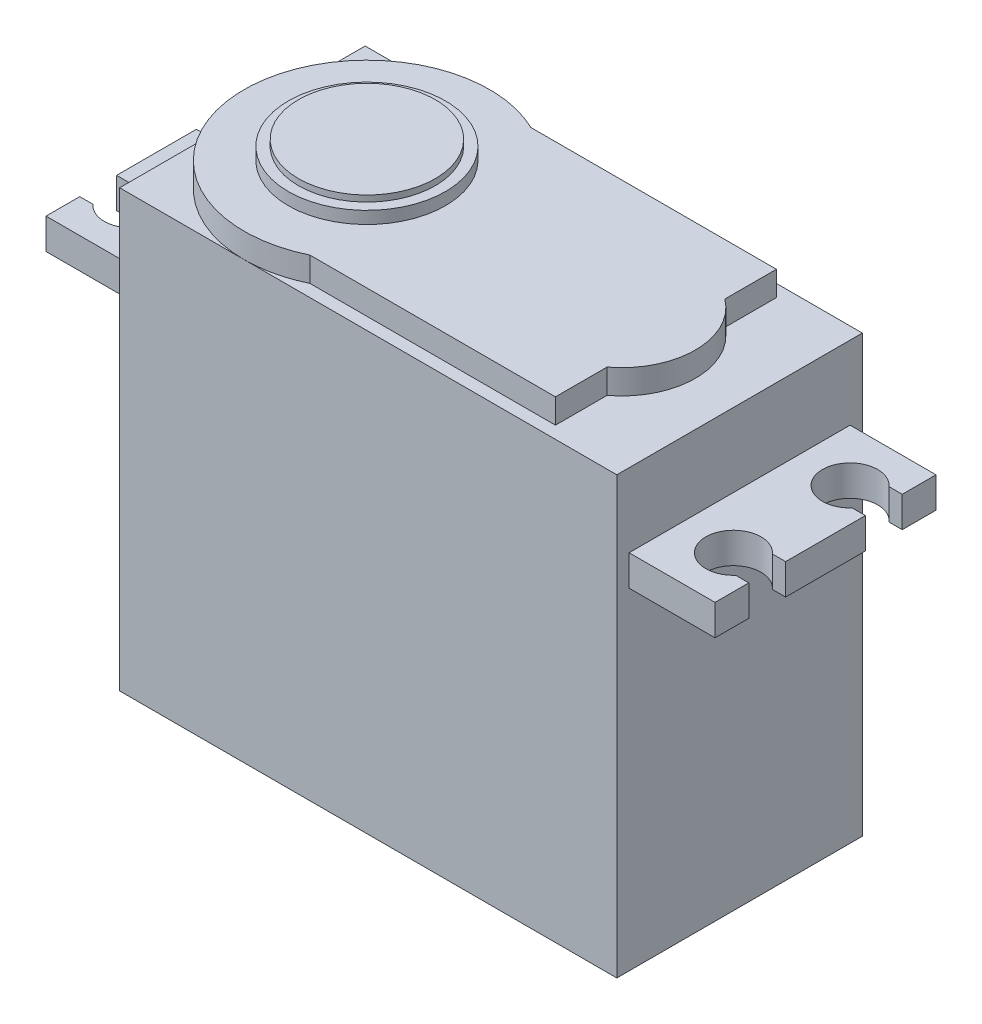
ISO-10303-21;
HEADER;
FILE_DESCRIPTION(('STEP AP214'),'2;1');
FILE_NAME('part.step','',(''),(''),'','','');
FILE_SCHEMA(('AUTOMOTIVE_DESIGN { 1 0 10303 214 1 1 1 1 }'));
ENDSEC;
DATA;
#1=APPLICATION_CONTEXT('core data for automotive mechanical design processes');
#2=APPLICATION_PROTOCOL_DEFINITION('international standard','automotive_design',2000,#1);
#3=PRODUCT_CONTEXT('',#1,'mechanical');
#4=PRODUCT('Part','Part','',(#3));
#5=PRODUCT_RELATED_PRODUCT_CATEGORY('part','',(#4));
#6=PRODUCT_DEFINITION_FORMATION('','',#4);
#7=PRODUCT_DEFINITION_CONTEXT('part definition',#1,'design');
#8=PRODUCT_DEFINITION('design','',#6,#7);
#9=PRODUCT_DEFINITION_SHAPE('','',#8);
#10=(LENGTH_UNIT() NAMED_UNIT(*) SI_UNIT(.MILLI.,.METRE.));
#11=(NAMED_UNIT(*) PLANE_ANGLE_UNIT() SI_UNIT($,.RADIAN.));
#12=(NAMED_UNIT(*) SI_UNIT($,.STERADIAN.) SOLID_ANGLE_UNIT());
#13=UNCERTAINTY_MEASURE_WITH_UNIT(LENGTH_MEASURE(1.E-05),#10,'distance_accuracy_value','');
#14=(GEOMETRIC_REPRESENTATION_CONTEXT(3) GLOBAL_UNCERTAINTY_ASSIGNED_CONTEXT((#13)) GLOBAL_UNIT_ASSIGNED_CONTEXT((#10,
#11,#12)) REPRESENTATION_CONTEXT('',''));
#15=CARTESIAN_POINT('',(0.,0.,0.));
#16=DIRECTION('',(0.,0.,1.));
#17=DIRECTION('',(1.,0.,0.));
#18=AXIS2_PLACEMENT_3D('',#15,#16,#17);
#19=CARTESIAN_POINT('',(-20.25,35.5,10.));
#20=DIRECTION('',(1.,0.,0.));
#21=DIRECTION('',(0.,0.,-1.));
#22=AXIS2_PLACEMENT_3D('',#19,#20,#21);
#23=PLANE('',#22);
#24=DIRECTION('',(0.,0.,1.));
#25=VECTOR('',#24,1.);
#26=CARTESIAN_POINT('',(-20.25,0.,10.));
#27=LINE('',#26,#25);
#28=CARTESIAN_POINT('',(-20.25,0.,-10.));
#29=VERTEX_POINT('',#28);
#30=CARTESIAN_POINT('',(-20.25,0.,10.));
#31=VERTEX_POINT('',#30);
#32=EDGE_CURVE('E512',#29,#31,#27,.T.);
#33=ORIENTED_EDGE('',*,*,#32,.T.);
#34=DIRECTION('',(0.,-1.,0.));
#35=VECTOR('',#34,1.);
#36=CARTESIAN_POINT('',(-20.25,35.5,10.));
#37=LINE('',#36,#35);
#38=CARTESIAN_POINT('',(-20.25,35.5,10.));
#39=VERTEX_POINT('',#38);
#40=EDGE_CURVE('E37',#39,#31,#37,.T.);
#41=ORIENTED_EDGE('',*,*,#40,.F.);
#42=DIRECTION('',(0.,0.,1.));
#43=VECTOR('',#42,1.);
#44=CARTESIAN_POINT('',(-20.25,35.5,10.));
#45=LINE('',#44,#43);
#46=CARTESIAN_POINT('',(-20.25,35.5,-10.));
#47=VERTEX_POINT('',#46);
#48=EDGE_CURVE('E513',#47,#39,#45,.T.);
#49=ORIENTED_EDGE('',*,*,#48,.F.);
#50=DIRECTION('',(0.,-1.,0.));
#51=VECTOR('',#50,1.);
#52=CARTESIAN_POINT('',(-20.25,35.5,-10.));
#53=LINE('',#52,#51);
#54=EDGE_CURVE('E527',#47,#29,#53,.T.);
#55=ORIENTED_EDGE('',*,*,#54,.T.);
#56=EDGE_LOOP('',(#33,#41,#49,#55));
#57=FACE_BOUND('',#56,.T.);
#58=DIRECTION('',(0.,1.,0.));
#59=VECTOR('',#58,1.);
#60=CARTESIAN_POINT('',(-20.25,27.,9.));
#61=LINE('',#60,#59);
#62=CARTESIAN_POINT('',(-20.25,27.,9.));
#63=VERTEX_POINT('',#62);
#64=CARTESIAN_POINT('',(-20.25,29.5,9.));
#65=VERTEX_POINT('',#64);
#66=EDGE_CURVE('E315',#63,#65,#61,.T.);
#67=ORIENTED_EDGE('',*,*,#66,.F.);
#68=DIRECTION('',(0.,0.,1.));
#69=VECTOR('',#68,1.);
#70=CARTESIAN_POINT('',(-20.25,27.,0.));
#71=LINE('',#70,#69);
#72=CARTESIAN_POINT('',(-20.25,27.,-9.));
#73=VERTEX_POINT('',#72);
#74=EDGE_CURVE('E51',#73,#63,#71,.T.);
#75=ORIENTED_EDGE('',*,*,#74,.F.);
#76=DIRECTION('',(0.,1.,0.));
#77=VECTOR('',#76,1.);
#78=CARTESIAN_POINT('',(-20.25,27.,-9.));
#79=LINE('',#78,#77);
#80=CARTESIAN_POINT('',(-20.25,29.5,-9.));
#81=VERTEX_POINT('',#80);
#82=EDGE_CURVE('E274',#73,#81,#79,.T.);
#83=ORIENTED_EDGE('',*,*,#82,.T.);
#84=DIRECTION('',(0.,0.,1.));
#85=VECTOR('',#84,1.);
#86=CARTESIAN_POINT('',(-20.25,29.5,0.));
#87=LINE('',#86,#85);
#88=EDGE_CURVE('E58',#81,#65,#87,.T.);
#89=ORIENTED_EDGE('',*,*,#88,.T.);
#90=EDGE_LOOP('',(#67,#75,#83,#89));
#91=FACE_BOUND('',#90,.T.);
#92=ADVANCED_FACE('F34',(#57,#91),#23,.F.);
#93=CARTESIAN_POINT('',(20.25,35.5,10.));
#94=DIRECTION('',(-1.,0.,0.));
#95=DIRECTION('',(0.,0.,1.));
#96=AXIS2_PLACEMENT_3D('',#93,#94,#95);
#97=PLANE('',#96);
#98=DIRECTION('',(0.,0.,-1.));
#99=VECTOR('',#98,1.);
#100=CARTESIAN_POINT('',(20.25,0.,10.));
#101=LINE('',#100,#99);
#102=CARTESIAN_POINT('',(20.25,0.,10.));
#103=VERTEX_POINT('',#102);
#104=CARTESIAN_POINT('',(20.25,0.,-10.));
#105=VERTEX_POINT('',#104);
#106=EDGE_CURVE('E532',#103,#105,#101,.T.);
#107=ORIENTED_EDGE('',*,*,#106,.T.);
#108=DIRECTION('',(0.,-1.,0.));
#109=VECTOR('',#108,1.);
#110=CARTESIAN_POINT('',(20.25,35.5,-10.));
#111=LINE('',#110,#109);
#112=CARTESIAN_POINT('',(20.25,35.5,-10.));
#113=VERTEX_POINT('',#112);
#114=EDGE_CURVE('E537',#113,#105,#111,.T.);
#115=ORIENTED_EDGE('',*,*,#114,.F.);
#116=DIRECTION('',(0.,0.,-1.));
#117=VECTOR('',#116,1.);
#118=CARTESIAN_POINT('',(20.25,35.5,10.));
#119=LINE('',#118,#117);
#120=CARTESIAN_POINT('',(20.25,35.5,10.));
#121=VERTEX_POINT('',#120);
#122=EDGE_CURVE('E521',#121,#113,#119,.T.);
#123=ORIENTED_EDGE('',*,*,#122,.F.);
#124=DIRECTION('',(0.,-1.,0.));
#125=VECTOR('',#124,1.);
#126=CARTESIAN_POINT('',(20.25,35.5,10.));
#127=LINE('',#126,#125);
#128=EDGE_CURVE('E539',#121,#103,#127,.T.);
#129=ORIENTED_EDGE('',*,*,#128,.T.);
#130=EDGE_LOOP('',(#107,#115,#123,#129));
#131=FACE_BOUND('',#130,.T.);
#132=DIRECTION('',(0.,0.,1.));
#133=VECTOR('',#132,1.);
#134=CARTESIAN_POINT('',(20.25,27.,0.));
#135=LINE('',#134,#133);
#136=CARTESIAN_POINT('',(20.25,27.,-9.));
#137=VERTEX_POINT('',#136);
#138=CARTESIAN_POINT('',(20.25,27.,9.));
#139=VERTEX_POINT('',#138);
#140=EDGE_CURVE('E402',#137,#139,#135,.T.);
#141=ORIENTED_EDGE('',*,*,#140,.T.);
#142=DIRECTION('',(0.,1.,0.));
#143=VECTOR('',#142,1.);
#144=CARTESIAN_POINT('',(20.25,27.,9.));
#145=LINE('',#144,#143);
#146=CARTESIAN_POINT('',(20.25,29.5,9.));
#147=VERTEX_POINT('',#146);
#148=EDGE_CURVE('E337',#139,#147,#145,.T.);
#149=ORIENTED_EDGE('',*,*,#148,.T.);
#150=DIRECTION('',(0.,0.,1.));
#151=VECTOR('',#150,1.);
#152=CARTESIAN_POINT('',(20.25,29.5,0.));
#153=LINE('',#152,#151);
#154=CARTESIAN_POINT('',(20.25,29.5,-9.));
#155=VERTEX_POINT('',#154);
#156=EDGE_CURVE('E388',#155,#147,#153,.T.);
#157=ORIENTED_EDGE('',*,*,#156,.F.);
#158=DIRECTION('',(0.,1.,0.));
#159=VECTOR('',#158,1.);
#160=CARTESIAN_POINT('',(20.25,27.,-9.));
#161=LINE('',#160,#159);
#162=EDGE_CURVE('E441',#137,#155,#161,.T.);
#163=ORIENTED_EDGE('',*,*,#162,.F.);
#164=EDGE_LOOP('',(#141,#149,#157,#163));
#165=FACE_BOUND('',#164,.T.);
#166=ADVANCED_FACE('F587',(#131,#165),#97,.F.);
#167=CARTESIAN_POINT('',(-10.1088989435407,38.5,0.));
#168=DIRECTION('',(0.,1.,0.));
#169=DIRECTION('',(0.,0.,1.));
#170=AXIS2_PLACEMENT_3D('',#167,#168,#169);
#171=PLANE('',#170);
#172=CARTESIAN_POINT('',(-10.1088989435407,38.5,0.));
#173=DIRECTION('',(0.,1.,0.));
#174=DIRECTION('',(0.,0.,1.));
#175=AXIS2_PLACEMENT_3D('',#172,#173,#174);
#176=CIRCLE('',#175,6.4);
#177=CARTESIAN_POINT('',(-10.1088989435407,38.5,6.40000000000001));
#178=VERTEX_POINT('',#177);
#179=EDGE_CURVE('E460',#178,#178,#176,.T.);
#180=ORIENTED_EDGE('',*,*,#179,.T.);
#181=EDGE_LOOP('',(#180));
#182=FACE_BOUND('',#181,.T.);
#183=CARTESIAN_POINT('',(-10.1088989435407,38.5,0.));
#184=DIRECTION('',(0.,1.,0.));
#185=DIRECTION('',(0.,0.,1.));
#186=AXIS2_PLACEMENT_3D('',#183,#184,#185);
#187=CIRCLE('',#186,5.575);
#188=CARTESIAN_POINT('',(-10.1088989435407,38.5,5.57500000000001));
#189=VERTEX_POINT('',#188);
#190=EDGE_CURVE('E444',#189,#189,#187,.T.);
#191=ORIENTED_EDGE('',*,*,#190,.F.);
#192=EDGE_LOOP('',(#191));
#193=FACE_BOUND('',#192,.T.);
#194=ADVANCED_FACE('F592',(#182,#193),#171,.T.);
#195=CARTESIAN_POINT('',(-10.1088989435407,37.5,0.));
#196=DIRECTION('',(0.,1.,0.));
#197=DIRECTION('',(0.,0.,1.));
#198=AXIS2_PLACEMENT_3D('',#195,#196,#197);
#199=PLANE('',#198);
#200=CARTESIAN_POINT('',(-10.1088989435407,37.5,0.));
#201=DIRECTION('',(0.,1.,0.));
#202=DIRECTION('',(0.,0.,1.));
#203=AXIS2_PLACEMENT_3D('',#200,#201,#202);
#204=CIRCLE('',#203,9.99999999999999);
#205=CARTESIAN_POINT('',(-5.74999999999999,37.5,-8.99999999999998));
#206=VERTEX_POINT('',#205);
#207=CARTESIAN_POINT('',(-5.74999999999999,37.5,9.00000000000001));
#208=VERTEX_POINT('',#207);
#209=EDGE_CURVE('E465',#206,#208,#204,.T.);
#210=ORIENTED_EDGE('',*,*,#209,.T.);
#211=DIRECTION('',(1.,0.,0.));
#212=VECTOR('',#211,1.);
#213=CARTESIAN_POINT('',(-5.74999999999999,37.5,9.00000000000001));
#214=LINE('',#213,#212);
#215=CARTESIAN_POINT('',(14.25,37.5,9.00000000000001));
#216=VERTEX_POINT('',#215);
#217=EDGE_CURVE('E468',#208,#216,#214,.T.);
#218=ORIENTED_EDGE('',*,*,#217,.T.);
#219=DIRECTION('',(0.,0.,-1.));
#220=VECTOR('',#219,1.);
#221=CARTESIAN_POINT('',(14.25,37.5,9.00000000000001));
#222=LINE('',#221,#220);
#223=CARTESIAN_POINT('',(14.25,37.5,4.8));
#224=VERTEX_POINT('',#223);
#225=EDGE_CURVE('E471',#216,#224,#222,.T.);
#226=ORIENTED_EDGE('',*,*,#225,.T.);
#227=CARTESIAN_POINT('',(10.65,37.5,0.));
#228=DIRECTION('',(0.,1.,0.));
#229=DIRECTION('',(0.,0.,-1.));
#230=AXIS2_PLACEMENT_3D('',#227,#228,#229);
#231=CIRCLE('',#230,6.00000000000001);
#232=CARTESIAN_POINT('',(14.25,37.5,-4.8));
#233=VERTEX_POINT('',#232);
#234=EDGE_CURVE('E473',#224,#233,#231,.T.);
#235=ORIENTED_EDGE('',*,*,#234,.T.);
#236=DIRECTION('',(0.,0.,-1.));
#237=VECTOR('',#236,1.);
#238=CARTESIAN_POINT('',(14.25,37.5,-9.));
#239=LINE('',#238,#237);
#240=CARTESIAN_POINT('',(14.25,37.5,-9.));
#241=VERTEX_POINT('',#240);
#242=EDGE_CURVE('E475',#233,#241,#239,.T.);
#243=ORIENTED_EDGE('',*,*,#242,.T.);
#244=DIRECTION('',(-1.,0.,0.));
#245=VECTOR('',#244,1.);
#246=CARTESIAN_POINT('',(-5.74999999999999,37.5,-8.99999999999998));
#247=LINE('',#246,#245);
#248=EDGE_CURVE('E477',#241,#206,#247,.T.);
#249=ORIENTED_EDGE('',*,*,#248,.T.);
#250=EDGE_LOOP('',(#210,#218,#226,#235,#243,#249));
#251=FACE_BOUND('',#250,.T.);
#252=CARTESIAN_POINT('',(-10.1088989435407,37.5,0.));
#253=DIRECTION('',(0.,1.,0.));
#254=DIRECTION('',(0.,0.,1.));
#255=AXIS2_PLACEMENT_3D('',#252,#253,#254);
#256=CIRCLE('',#255,6.4);
#257=CARTESIAN_POINT('',(-10.1088989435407,37.5,6.40000000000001));
#258=VERTEX_POINT('',#257);
#259=EDGE_CURVE('E457',#258,#258,#256,.T.);
#260=ORIENTED_EDGE('',*,*,#259,.F.);
#261=EDGE_LOOP('',(#260));
#262=FACE_BOUND('',#261,.T.);
#263=ADVANCED_FACE('F560',(#251,#262),#199,.T.);
#264=CARTESIAN_POINT('',(0.,35.5,0.));
#265=DIRECTION('',(0.,-1.,0.));
#266=DIRECTION('',(0.,0.,-1.));
#267=AXIS2_PLACEMENT_3D('',#264,#265,#266);
#268=PLANE('',#267);
#269=CARTESIAN_POINT('',(-10.1088989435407,35.5,0.));
#270=DIRECTION('',(0.,1.,0.));
#271=DIRECTION('',(0.,0.,1.));
#272=AXIS2_PLACEMENT_3D('',#269,#270,#271);
#273=CIRCLE('',#272,9.99999999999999);
#274=CARTESIAN_POINT('',(-5.74999999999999,35.5,-8.99999999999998));
#275=VERTEX_POINT('',#274);
#276=CARTESIAN_POINT('',(-10.1088989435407,35.5,-10.));
#277=VERTEX_POINT('',#276);
#278=EDGE_CURVE('E44',#275,#277,#273,.T.);
#279=ORIENTED_EDGE('',*,*,#278,.F.);
#280=DIRECTION('',(-1.,0.,0.));
#281=VECTOR('',#280,1.);
#282=CARTESIAN_POINT('',(-5.74999999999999,35.5,-8.99999999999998));
#283=LINE('',#282,#281);
#284=CARTESIAN_POINT('',(14.25,35.5,-9.));
#285=VERTEX_POINT('',#284);
#286=EDGE_CURVE('E469',#285,#275,#283,.T.);
#287=ORIENTED_EDGE('',*,*,#286,.F.);
#288=DIRECTION('',(0.,0.,-1.));
#289=VECTOR('',#288,1.);
#290=CARTESIAN_POINT('',(14.25,35.5,-9.));
#291=LINE('',#290,#289);
#292=CARTESIAN_POINT('',(14.25,35.5,-4.8));
#293=VERTEX_POINT('',#292);
#294=EDGE_CURVE('E490',#293,#285,#291,.T.);
#295=ORIENTED_EDGE('',*,*,#294,.F.);
#296=CARTESIAN_POINT('',(10.65,35.5,0.));
#297=DIRECTION('',(0.,1.,0.));
#298=DIRECTION('',(0.,0.,-1.));
#299=AXIS2_PLACEMENT_3D('',#296,#297,#298);
#300=CIRCLE('',#299,6.00000000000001);
#301=CARTESIAN_POINT('',(14.25,35.5,4.8));
#302=VERTEX_POINT('',#301);
#303=EDGE_CURVE('E487',#302,#293,#300,.T.);
#304=ORIENTED_EDGE('',*,*,#303,.F.);
#305=DIRECTION('',(0.,0.,-1.));
#306=VECTOR('',#305,1.);
#307=CARTESIAN_POINT('',(14.25,35.5,9.00000000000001));
#308=LINE('',#307,#306);
#309=CARTESIAN_POINT('',(14.25,35.5,9.00000000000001));
#310=VERTEX_POINT('',#309);
#311=EDGE_CURVE('E484',#310,#302,#308,.T.);
#312=ORIENTED_EDGE('',*,*,#311,.F.);
#313=DIRECTION('',(1.,0.,0.));
#314=VECTOR('',#313,1.);
#315=CARTESIAN_POINT('',(-5.74999999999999,35.5,9.00000000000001));
#316=LINE('',#315,#314);
#317=CARTESIAN_POINT('',(-5.74999999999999,35.5,9.00000000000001));
#318=VERTEX_POINT('',#317);
#319=EDGE_CURVE('E481',#318,#310,#316,.T.);
#320=ORIENTED_EDGE('',*,*,#319,.F.);
#321=CARTESIAN_POINT('',(-10.1088989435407,35.5,10.));
#322=VERTEX_POINT('',#321);
#323=EDGE_CURVE('E42',#322,#318,#273,.T.);
#324=ORIENTED_EDGE('',*,*,#323,.F.);
#325=DIRECTION('',(1.,0.,0.));
#326=VECTOR('',#325,1.);
#327=CARTESIAN_POINT('',(-20.25,35.5,10.));
#328=LINE('',#327,#326);
#329=EDGE_CURVE('E516',#322,#121,#328,.T.);
#330=ORIENTED_EDGE('',*,*,#329,.T.);
#331=ORIENTED_EDGE('',*,*,#122,.T.);
#332=DIRECTION('',(-1.,0.,0.));
#333=VECTOR('',#332,1.);
#334=CARTESIAN_POINT('',(-20.25,35.5,-10.));
#335=LINE('',#334,#333);
#336=EDGE_CURVE('E524',#113,#277,#335,.T.);
#337=ORIENTED_EDGE('',*,*,#336,.T.);
#338=EDGE_LOOP('',(#279,#287,#295,#304,#312,#320,#324,#330,#331,#337));
#339=FACE_BOUND('',#338,.T.);
#340=ADVANCED_FACE('F567',(#339),#268,.F.);
#341=EDGE_CURVE('E11',#277,#322,#273,.T.);
#342=ORIENTED_EDGE('',*,*,#341,.F.);
#343=EDGE_CURVE('E523',#277,#47,#335,.T.);
#344=ORIENTED_EDGE('',*,*,#343,.T.);
#345=ORIENTED_EDGE('',*,*,#48,.T.);
#346=EDGE_CURVE('E518',#39,#322,#328,.T.);
#347=ORIENTED_EDGE('',*,*,#346,.T.);
#348=EDGE_LOOP('',(#342,#344,#345,#347));
#349=FACE_BOUND('',#348,.T.);
#350=ADVANCED_FACE('F931',(#349),#268,.F.);
#351=CARTESIAN_POINT('',(-20.25,35.5,10.));
#352=DIRECTION('',(0.,0.,-1.));
#353=DIRECTION('',(-1.,0.,0.));
#354=AXIS2_PLACEMENT_3D('',#351,#352,#353);
#355=PLANE('',#354);
#356=DIRECTION('',(1.,0.,0.));
#357=VECTOR('',#356,1.);
#358=CARTESIAN_POINT('',(-20.25,0.,10.));
#359=LINE('',#358,#357);
#360=EDGE_CURVE('E530',#31,#103,#359,.T.);
#361=ORIENTED_EDGE('',*,*,#360,.T.);
#362=ORIENTED_EDGE('',*,*,#128,.F.);
#363=ORIENTED_EDGE('',*,*,#329,.F.);
#364=ORIENTED_EDGE('',*,*,#346,.F.);
#365=ORIENTED_EDGE('',*,*,#40,.T.);
#366=EDGE_LOOP('',(#361,#362,#363,#364,#365));
#367=FACE_BOUND('',#366,.T.);
#368=ADVANCED_FACE('F939',(#367),#355,.F.);
#369=CARTESIAN_POINT('',(-20.25,35.5,-10.));
#370=DIRECTION('',(0.,0.,1.));
#371=DIRECTION('',(1.,0.,0.));
#372=AXIS2_PLACEMENT_3D('',#369,#370,#371);
#373=PLANE('',#372);
#374=DIRECTION('',(-1.,0.,0.));
#375=VECTOR('',#374,1.);
#376=CARTESIAN_POINT('',(-20.25,0.,-10.));
#377=LINE('',#376,#375);
#378=EDGE_CURVE('E517',#105,#29,#377,.T.);
#379=ORIENTED_EDGE('',*,*,#378,.T.);
#380=ORIENTED_EDGE('',*,*,#54,.F.);
#381=ORIENTED_EDGE('',*,*,#343,.F.);
#382=ORIENTED_EDGE('',*,*,#336,.F.);
#383=ORIENTED_EDGE('',*,*,#114,.T.);
#384=EDGE_LOOP('',(#379,#380,#381,#382,#383));
#385=FACE_BOUND('',#384,.T.);
#386=ADVANCED_FACE('F946',(#385),#373,.F.);
#387=CARTESIAN_POINT('',(0.,0.,0.));
#388=DIRECTION('',(0.,-1.,0.));
#389=DIRECTION('',(0.,0.,-1.));
#390=AXIS2_PLACEMENT_3D('',#387,#388,#389);
#391=PLANE('',#390);
#392=ORIENTED_EDGE('',*,*,#32,.F.);
#393=ORIENTED_EDGE('',*,*,#378,.F.);
#394=ORIENTED_EDGE('',*,*,#106,.F.);
#395=ORIENTED_EDGE('',*,*,#360,.F.);
#396=EDGE_LOOP('',(#392,#393,#394,#395));
#397=FACE_BOUND('',#396,.T.);
#398=ADVANCED_FACE('F952',(#397),#391,.T.);
#399=CARTESIAN_POINT('',(-10.1088989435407,37.5,0.));
#400=DIRECTION('',(0.,-1.,0.));
#401=DIRECTION('',(0.,0.,-1.));
#402=AXIS2_PLACEMENT_3D('',#399,#400,#401);
#403=CYLINDRICAL_SURFACE('',#402,9.99999999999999);
#404=ORIENTED_EDGE('',*,*,#278,.T.);
#405=ORIENTED_EDGE('',*,*,#341,.T.);
#406=ORIENTED_EDGE('',*,*,#323,.T.);
#407=DIRECTION('',(0.,-1.,0.));
#408=VECTOR('',#407,1.);
#409=CARTESIAN_POINT('',(-5.74999999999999,37.5,9.00000000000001));
#410=LINE('',#409,#408);
#411=EDGE_CURVE('E509',#208,#318,#410,.T.);
#412=ORIENTED_EDGE('',*,*,#411,.F.);
#413=ORIENTED_EDGE('',*,*,#209,.F.);
#414=DIRECTION('',(0.,-1.,0.));
#415=VECTOR('',#414,1.);
#416=CARTESIAN_POINT('',(-5.74999999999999,37.5,-8.99999999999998));
#417=LINE('',#416,#415);
#418=EDGE_CURVE('E478',#206,#275,#417,.T.);
#419=ORIENTED_EDGE('',*,*,#418,.T.);
#420=EDGE_LOOP('',(#404,#405,#406,#412,#413,#419));
#421=FACE_BOUND('',#420,.T.);
#422=ADVANCED_FACE('F551',(#421),#403,.T.);
#423=CARTESIAN_POINT('',(-5.74999999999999,37.5,9.00000000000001));
#424=DIRECTION('',(0.,0.,-1.));
#425=DIRECTION('',(-1.,0.,0.));
#426=AXIS2_PLACEMENT_3D('',#423,#424,#425);
#427=PLANE('',#426);
#428=ORIENTED_EDGE('',*,*,#319,.T.);
#429=DIRECTION('',(0.,-1.,0.));
#430=VECTOR('',#429,1.);
#431=CARTESIAN_POINT('',(14.25,37.5,9.00000000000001));
#432=LINE('',#431,#430);
#433=EDGE_CURVE('E506',#216,#310,#432,.T.);
#434=ORIENTED_EDGE('',*,*,#433,.F.);
#435=ORIENTED_EDGE('',*,*,#217,.F.);
#436=ORIENTED_EDGE('',*,*,#411,.T.);
#437=EDGE_LOOP('',(#428,#434,#435,#436));
#438=FACE_BOUND('',#437,.T.);
#439=ADVANCED_FACE('F556',(#438),#427,.F.);
#440=CARTESIAN_POINT('',(14.25,37.5,9.00000000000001));
#441=DIRECTION('',(-1.,0.,0.));
#442=DIRECTION('',(0.,0.,1.));
#443=AXIS2_PLACEMENT_3D('',#440,#441,#442);
#444=PLANE('',#443);
#445=ORIENTED_EDGE('',*,*,#311,.T.);
#446=DIRECTION('',(0.,-1.,0.));
#447=VECTOR('',#446,1.);
#448=CARTESIAN_POINT('',(14.25,37.5,4.8));
#449=LINE('',#448,#447);
#450=EDGE_CURVE('E503',#224,#302,#449,.T.);
#451=ORIENTED_EDGE('',*,*,#450,.F.);
#452=ORIENTED_EDGE('',*,*,#225,.F.);
#453=ORIENTED_EDGE('',*,*,#433,.T.);
#454=EDGE_LOOP('',(#445,#451,#452,#453));
#455=FACE_BOUND('',#454,.T.);
#456=ADVANCED_FACE('F577',(#455),#444,.F.);
#457=CARTESIAN_POINT('',(10.65,37.5,0.));
#458=DIRECTION('',(0.,-1.,0.));
#459=DIRECTION('',(0.,0.,-1.));
#460=AXIS2_PLACEMENT_3D('',#457,#458,#459);
#461=CYLINDRICAL_SURFACE('',#460,6.00000000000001);
#462=ORIENTED_EDGE('',*,*,#303,.T.);
#463=DIRECTION('',(0.,-1.,0.));
#464=VECTOR('',#463,1.);
#465=CARTESIAN_POINT('',(14.25,37.5,-4.8));
#466=LINE('',#465,#464);
#467=EDGE_CURVE('E500',#233,#293,#466,.T.);
#468=ORIENTED_EDGE('',*,*,#467,.F.);
#469=ORIENTED_EDGE('',*,*,#234,.F.);
#470=ORIENTED_EDGE('',*,*,#450,.T.);
#471=EDGE_LOOP('',(#462,#468,#469,#470));
#472=FACE_BOUND('',#471,.T.);
#473=ADVANCED_FACE('F574',(#472),#461,.T.);
#474=CARTESIAN_POINT('',(14.25,37.5,-9.));
#475=DIRECTION('',(-1.,0.,0.));
#476=DIRECTION('',(0.,0.,1.));
#477=AXIS2_PLACEMENT_3D('',#474,#475,#476);
#478=PLANE('',#477);
#479=ORIENTED_EDGE('',*,*,#294,.T.);
#480=DIRECTION('',(0.,-1.,0.));
#481=VECTOR('',#480,1.);
#482=CARTESIAN_POINT('',(14.25,37.5,-9.));
#483=LINE('',#482,#481);
#484=EDGE_CURVE('E497',#241,#285,#483,.T.);
#485=ORIENTED_EDGE('',*,*,#484,.F.);
#486=ORIENTED_EDGE('',*,*,#242,.F.);
#487=ORIENTED_EDGE('',*,*,#467,.T.);
#488=EDGE_LOOP('',(#479,#485,#486,#487));
#489=FACE_BOUND('',#488,.T.);
#490=ADVANCED_FACE('F569',(#489),#478,.F.);
#491=CARTESIAN_POINT('',(-5.74999999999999,37.5,-8.99999999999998));
#492=DIRECTION('',(0.,0.,1.));
#493=DIRECTION('',(1.,0.,0.));
#494=AXIS2_PLACEMENT_3D('',#491,#492,#493);
#495=PLANE('',#494);
#496=ORIENTED_EDGE('',*,*,#286,.T.);
#497=ORIENTED_EDGE('',*,*,#418,.F.);
#498=ORIENTED_EDGE('',*,*,#248,.F.);
#499=ORIENTED_EDGE('',*,*,#484,.T.);
#500=EDGE_LOOP('',(#496,#497,#498,#499));
#501=FACE_BOUND('',#500,.T.);
#502=ADVANCED_FACE('F565',(#501),#495,.F.);
#503=CARTESIAN_POINT('',(-10.1088989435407,38.5,0.));
#504=DIRECTION('',(0.,-1.,0.));
#505=DIRECTION('',(0.,0.,-1.));
#506=AXIS2_PLACEMENT_3D('',#503,#504,#505);
#507=CYLINDRICAL_SURFACE('',#506,6.4);
#508=ORIENTED_EDGE('',*,*,#179,.F.);
#509=EDGE_LOOP('',(#508));
#510=FACE_BOUND('',#509,.T.);
#511=ORIENTED_EDGE('',*,*,#259,.T.);
#512=EDGE_LOOP('',(#511));
#513=FACE_BOUND('',#512,.T.);
#514=ADVANCED_FACE('F722',(#510,#513),#507,.T.);
#515=CARTESIAN_POINT('',(-10.1088989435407,39.,0.));
#516=DIRECTION('',(0.,-1.,0.));
#517=DIRECTION('',(0.,0.,-1.));
#518=AXIS2_PLACEMENT_3D('',#515,#516,#517);
#519=CYLINDRICAL_SURFACE('',#518,5.575);
#520=CARTESIAN_POINT('',(-10.1088989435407,39.,0.));
#521=DIRECTION('',(0.,1.,0.));
#522=DIRECTION('',(0.,0.,1.));
#523=AXIS2_PLACEMENT_3D('',#520,#521,#522);
#524=CIRCLE('',#523,5.575);
#525=CARTESIAN_POINT('',(-10.1088989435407,39.,5.57500000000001));
#526=VERTEX_POINT('',#525);
#527=EDGE_CURVE('E454',#526,#526,#524,.T.);
#528=ORIENTED_EDGE('',*,*,#527,.F.);
#529=EDGE_LOOP('',(#528));
#530=FACE_BOUND('',#529,.T.);
#531=ORIENTED_EDGE('',*,*,#190,.T.);
#532=EDGE_LOOP('',(#531));
#533=FACE_BOUND('',#532,.T.);
#534=ADVANCED_FACE('F718',(#530,#533),#519,.T.);
#535=CARTESIAN_POINT('',(-10.1088989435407,39.,0.));
#536=DIRECTION('',(0.,1.,0.));
#537=DIRECTION('',(0.,0.,1.));
#538=AXIS2_PLACEMENT_3D('',#535,#536,#537);
#539=PLANE('',#538);
#540=ORIENTED_EDGE('',*,*,#527,.T.);
#541=EDGE_LOOP('',(#540));
#542=FACE_BOUND('',#541,.T.);
#543=ADVANCED_FACE('F696',(#542),#539,.T.);
#544=CARTESIAN_POINT('',(20.25,27.,-9.));
#545=DIRECTION('',(0.,0.,-1.));
#546=DIRECTION('',(-1.,0.,0.));
#547=AXIS2_PLACEMENT_3D('',#544,#545,#546);
#548=PLANE('',#547);
#549=DIRECTION('',(-1.,0.,0.));
#550=VECTOR('',#549,1.);
#551=CARTESIAN_POINT('',(20.25,29.5,-9.));
#552=LINE('',#551,#550);
#553=CARTESIAN_POINT('',(27.25,29.5,-9.));
#554=VERTEX_POINT('',#553);
#555=EDGE_CURVE('E405',#554,#155,#552,.T.);
#556=ORIENTED_EDGE('',*,*,#555,.F.);
#557=DIRECTION('',(0.,1.,0.));
#558=VECTOR('',#557,1.);
#559=CARTESIAN_POINT('',(27.25,27.,-9.));
#560=LINE('',#559,#558);
#561=CARTESIAN_POINT('',(27.25,27.,-9.));
#562=VERTEX_POINT('',#561);
#563=EDGE_CURVE('E445',#562,#554,#560,.T.);
#564=ORIENTED_EDGE('',*,*,#563,.F.);
#565=DIRECTION('',(-1.,0.,0.));
#566=VECTOR('',#565,1.);
#567=CARTESIAN_POINT('',(20.25,27.,-9.));
#568=LINE('',#567,#566);
#569=EDGE_CURVE('E420',#562,#137,#568,.T.);
#570=ORIENTED_EDGE('',*,*,#569,.T.);
#571=ORIENTED_EDGE('',*,*,#162,.T.);
#572=EDGE_LOOP('',(#556,#564,#570,#571));
#573=FACE_BOUND('',#572,.T.);
#574=ADVANCED_FACE('F692',(#573),#548,.T.);
#575=CARTESIAN_POINT('',(27.25,27.,-6.25));
#576=DIRECTION('',(1.,0.,0.));
#577=DIRECTION('',(0.,0.,-1.));
#578=AXIS2_PLACEMENT_3D('',#575,#576,#577);
#579=PLANE('',#578);
#580=DIRECTION('',(0.,0.,-1.));
#581=VECTOR('',#580,1.);
#582=CARTESIAN_POINT('',(27.25,29.5,-6.25));
#583=LINE('',#582,#581);
#584=CARTESIAN_POINT('',(27.25,29.5,-6.25));
#585=VERTEX_POINT('',#584);
#586=EDGE_CURVE('E437',#585,#554,#583,.T.);
#587=ORIENTED_EDGE('',*,*,#586,.F.);
#588=DIRECTION('',(0.,1.,0.));
#589=VECTOR('',#588,1.);
#590=CARTESIAN_POINT('',(27.25,27.,-6.25));
#591=LINE('',#590,#589);
#592=CARTESIAN_POINT('',(27.25,27.,-6.25));
#593=VERTEX_POINT('',#592);
#594=EDGE_CURVE('E447',#593,#585,#591,.T.);
#595=ORIENTED_EDGE('',*,*,#594,.F.);
#596=DIRECTION('',(0.,0.,-1.));
#597=VECTOR('',#596,1.);
#598=CARTESIAN_POINT('',(27.25,27.,-6.25));
#599=LINE('',#598,#597);
#600=EDGE_CURVE('E417',#593,#562,#599,.T.);
#601=ORIENTED_EDGE('',*,*,#600,.T.);
#602=ORIENTED_EDGE('',*,*,#563,.T.);
#603=EDGE_LOOP('',(#587,#595,#601,#602));
#604=FACE_BOUND('',#603,.T.);
#605=ADVANCED_FACE('F695',(#604),#579,.T.);
#606=CARTESIAN_POINT('',(26.1770509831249,27.,-6.25));
#607=DIRECTION('',(0.,0.,1.));
#608=DIRECTION('',(1.,0.,0.));
#609=AXIS2_PLACEMENT_3D('',#606,#607,#608);
#610=PLANE('',#609);
#611=DIRECTION('',(1.,0.,0.));
#612=VECTOR('',#611,1.);
#613=CARTESIAN_POINT('',(26.1770509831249,29.5,-6.25));
#614=LINE('',#613,#612);
#615=CARTESIAN_POINT('',(26.1770509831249,29.5,-6.25));
#616=VERTEX_POINT('',#615);
#617=EDGE_CURVE('E434',#616,#585,#614,.T.);
#618=ORIENTED_EDGE('',*,*,#617,.F.);
#619=DIRECTION('',(0.,1.,0.));
#620=VECTOR('',#619,1.);
#621=CARTESIAN_POINT('',(26.1770509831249,27.,-6.25));
#622=LINE('',#621,#620);
#623=CARTESIAN_POINT('',(26.1770509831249,27.,-6.25));
#624=VERTEX_POINT('',#623);
#625=EDGE_CURVE('E449',#624,#616,#622,.T.);
#626=ORIENTED_EDGE('',*,*,#625,.F.);
#627=DIRECTION('',(1.,0.,0.));
#628=VECTOR('',#627,1.);
#629=CARTESIAN_POINT('',(26.1770509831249,27.,-6.25));
#630=LINE('',#629,#628);
#631=EDGE_CURVE('E414',#624,#593,#630,.T.);
#632=ORIENTED_EDGE('',*,*,#631,.T.);
#633=ORIENTED_EDGE('',*,*,#594,.T.);
#634=EDGE_LOOP('',(#618,#626,#632,#633));
#635=FACE_BOUND('',#634,.T.);
#636=ADVANCED_FACE('F700',(#635),#610,.T.);
#637=CARTESIAN_POINT('',(24.5,27.,-4.75));
#638=DIRECTION('',(0.,1.,0.));
#639=DIRECTION('',(0.,0.,1.));
#640=AXIS2_PLACEMENT_3D('',#637,#638,#639);
#641=CYLINDRICAL_SURFACE('',#640,2.25);
#642=CARTESIAN_POINT('',(24.5,29.5,-4.75));
#643=DIRECTION('',(0.,-1.,0.));
#644=DIRECTION('',(0.,0.,1.));
#645=AXIS2_PLACEMENT_3D('',#642,#643,#644);
#646=CIRCLE('',#645,2.25);
#647=CARTESIAN_POINT('',(26.1770509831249,29.5,-3.25));
#648=VERTEX_POINT('',#647);
#649=EDGE_CURVE('E431',#648,#616,#646,.T.);
#650=ORIENTED_EDGE('',*,*,#649,.F.);
#651=DIRECTION('',(0.,1.,0.));
#652=VECTOR('',#651,1.);
#653=CARTESIAN_POINT('',(26.1770509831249,27.,-3.25));
#654=LINE('',#653,#652);
#655=CARTESIAN_POINT('',(26.1770509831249,27.,-3.25));
#656=VERTEX_POINT('',#655);
#657=EDGE_CURVE('E451',#656,#648,#654,.T.);
#658=ORIENTED_EDGE('',*,*,#657,.F.);
#659=CARTESIAN_POINT('',(24.5,27.,-4.75));
#660=DIRECTION('',(0.,-1.,0.));
#661=DIRECTION('',(0.,0.,1.));
#662=AXIS2_PLACEMENT_3D('',#659,#660,#661);
#663=CIRCLE('',#662,2.25);
#664=EDGE_CURVE('E411',#656,#624,#663,.T.);
#665=ORIENTED_EDGE('',*,*,#664,.T.);
#666=ORIENTED_EDGE('',*,*,#625,.T.);
#667=EDGE_LOOP('',(#650,#658,#665,#666));
#668=FACE_BOUND('',#667,.T.);
#669=ADVANCED_FACE('F704',(#668),#641,.F.);
#670=CARTESIAN_POINT('',(26.1770509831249,27.,-3.25));
#671=DIRECTION('',(0.,0.,-1.));
#672=DIRECTION('',(-1.,0.,0.));
#673=AXIS2_PLACEMENT_3D('',#670,#671,#672);
#674=PLANE('',#673);
#675=DIRECTION('',(-1.,0.,0.));
#676=VECTOR('',#675,1.);
#677=CARTESIAN_POINT('',(26.1770509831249,29.5,-3.25));
#678=LINE('',#677,#676);
#679=CARTESIAN_POINT('',(27.25,29.5,-3.25));
#680=VERTEX_POINT('',#679);
#681=EDGE_CURVE('E428',#680,#648,#678,.T.);
#682=ORIENTED_EDGE('',*,*,#681,.F.);
#683=DIRECTION('',(0.,1.,0.));
#684=VECTOR('',#683,1.);
#685=CARTESIAN_POINT('',(27.25,27.,-3.25));
#686=LINE('',#685,#684);
#687=CARTESIAN_POINT('',(27.25,27.,-3.25));
#688=VERTEX_POINT('',#687);
#689=EDGE_CURVE('E423',#688,#680,#686,.T.);
#690=ORIENTED_EDGE('',*,*,#689,.F.);
#691=DIRECTION('',(-1.,0.,0.));
#692=VECTOR('',#691,1.);
#693=CARTESIAN_POINT('',(26.1770509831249,27.,-3.25));
#694=LINE('',#693,#692);
#695=EDGE_CURVE('E408',#688,#656,#694,.T.);
#696=ORIENTED_EDGE('',*,*,#695,.T.);
#697=ORIENTED_EDGE('',*,*,#657,.T.);
#698=EDGE_LOOP('',(#682,#690,#696,#697));
#699=FACE_BOUND('',#698,.T.);
#700=ADVANCED_FACE('F708',(#699),#674,.T.);
#701=CARTESIAN_POINT('',(27.25,27.,0.));
#702=DIRECTION('',(1.,0.,0.));
#703=DIRECTION('',(0.,0.,-1.));
#704=AXIS2_PLACEMENT_3D('',#701,#702,#703);
#705=PLANE('',#704);
#706=DIRECTION('',(0.,0.,-1.));
#707=VECTOR('',#706,1.);
#708=CARTESIAN_POINT('',(27.25,29.5,0.));
#709=LINE('',#708,#707);
#710=CARTESIAN_POINT('',(27.25,29.5,3.25));
#711=VERTEX_POINT('',#710);
#712=EDGE_CURVE('E425',#711,#680,#709,.T.);
#713=ORIENTED_EDGE('',*,*,#712,.F.);
#714=DIRECTION('',(0.,1.,0.));
#715=VECTOR('',#714,1.);
#716=CARTESIAN_POINT('',(27.25,27.,3.25));
#717=LINE('',#716,#715);
#718=CARTESIAN_POINT('',(27.25,27.,3.25));
#719=VERTEX_POINT('',#718);
#720=EDGE_CURVE('E347',#719,#711,#717,.T.);
#721=ORIENTED_EDGE('',*,*,#720,.F.);
#722=DIRECTION('',(0.,0.,-1.));
#723=VECTOR('',#722,1.);
#724=CARTESIAN_POINT('',(27.25,27.,0.));
#725=LINE('',#724,#723);
#726=EDGE_CURVE('E404',#719,#688,#725,.T.);
#727=ORIENTED_EDGE('',*,*,#726,.T.);
#728=ORIENTED_EDGE('',*,*,#689,.T.);
#729=EDGE_LOOP('',(#713,#721,#727,#728));
#730=FACE_BOUND('',#729,.T.);
#731=ADVANCED_FACE('F687',(#730),#705,.T.);
#732=CARTESIAN_POINT('',(24.5,27.,-4.75));
#733=DIRECTION('',(0.,1.,0.));
#734=DIRECTION('',(0.,0.,1.));
#735=AXIS2_PLACEMENT_3D('',#732,#733,#734);
#736=PLANE('',#735);
#737=ORIENTED_EDGE('',*,*,#140,.F.);
#738=ORIENTED_EDGE('',*,*,#569,.F.);
#739=ORIENTED_EDGE('',*,*,#600,.F.);
#740=ORIENTED_EDGE('',*,*,#631,.F.);
#741=ORIENTED_EDGE('',*,*,#664,.F.);
#742=ORIENTED_EDGE('',*,*,#695,.F.);
#743=ORIENTED_EDGE('',*,*,#726,.F.);
#744=DIRECTION('',(-1.,0.,0.));
#745=VECTOR('',#744,1.);
#746=CARTESIAN_POINT('',(26.1770509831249,27.,3.25));
#747=LINE('',#746,#745);
#748=CARTESIAN_POINT('',(26.1770509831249,27.,3.25));
#749=VERTEX_POINT('',#748);
#750=EDGE_CURVE('E335',#719,#749,#747,.T.);
#751=ORIENTED_EDGE('',*,*,#750,.T.);
#752=CARTESIAN_POINT('',(24.5,27.,4.75));
#753=DIRECTION('',(0.,1.,0.));
#754=DIRECTION('',(0.,0.,-1.));
#755=AXIS2_PLACEMENT_3D('',#752,#753,#754);
#756=CIRCLE('',#755,2.25);
#757=CARTESIAN_POINT('',(26.1770509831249,27.,6.25));
#758=VERTEX_POINT('',#757);
#759=EDGE_CURVE('E333',#749,#758,#756,.T.);
#760=ORIENTED_EDGE('',*,*,#759,.T.);
#761=DIRECTION('',(1.,0.,0.));
#762=VECTOR('',#761,1.);
#763=CARTESIAN_POINT('',(26.1770509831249,27.,6.25));
#764=LINE('',#763,#762);
#765=CARTESIAN_POINT('',(27.25,27.,6.25));
#766=VERTEX_POINT('',#765);
#767=EDGE_CURVE('E331',#758,#766,#764,.T.);
#768=ORIENTED_EDGE('',*,*,#767,.T.);
#769=DIRECTION('',(0.,0.,1.));
#770=VECTOR('',#769,1.);
#771=CARTESIAN_POINT('',(27.25,27.,6.25));
#772=LINE('',#771,#770);
#773=CARTESIAN_POINT('',(27.25,27.,9.));
#774=VERTEX_POINT('',#773);
#775=EDGE_CURVE('E328',#766,#774,#772,.T.);
#776=ORIENTED_EDGE('',*,*,#775,.T.);
#777=DIRECTION('',(-1.,0.,0.));
#778=VECTOR('',#777,1.);
#779=CARTESIAN_POINT('',(20.25,27.,9.));
#780=LINE('',#779,#778);
#781=EDGE_CURVE('E325',#774,#139,#780,.T.);
#782=ORIENTED_EDGE('',*,*,#781,.T.);
#783=EDGE_LOOP('',(#737,#738,#739,#740,#741,#742,#743,#751,#760,#768,#776,#782));
#784=FACE_BOUND('',#783,.T.);
#785=ADVANCED_FACE('F684',(#784),#736,.F.);
#786=CARTESIAN_POINT('',(24.5,29.5,-4.75));
#787=DIRECTION('',(0.,1.,0.));
#788=DIRECTION('',(0.,0.,1.));
#789=AXIS2_PLACEMENT_3D('',#786,#787,#788);
#790=PLANE('',#789);
#791=ORIENTED_EDGE('',*,*,#156,.T.);
#792=DIRECTION('',(-1.,0.,0.));
#793=VECTOR('',#792,1.);
#794=CARTESIAN_POINT('',(20.25,29.5,9.));
#795=LINE('',#794,#793);
#796=CARTESIAN_POINT('',(27.25,29.5,9.));
#797=VERTEX_POINT('',#796);
#798=EDGE_CURVE('E317',#797,#147,#795,.T.);
#799=ORIENTED_EDGE('',*,*,#798,.F.);
#800=DIRECTION('',(0.,0.,1.));
#801=VECTOR('',#800,1.);
#802=CARTESIAN_POINT('',(27.25,29.5,6.25));
#803=LINE('',#802,#801);
#804=CARTESIAN_POINT('',(27.25,29.5,6.25));
#805=VERTEX_POINT('',#804);
#806=EDGE_CURVE('E340',#805,#797,#803,.T.);
#807=ORIENTED_EDGE('',*,*,#806,.F.);
#808=DIRECTION('',(1.,0.,0.));
#809=VECTOR('',#808,1.);
#810=CARTESIAN_POINT('',(26.1770509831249,29.5,6.25));
#811=LINE('',#810,#809);
#812=CARTESIAN_POINT('',(26.1770509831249,29.5,6.25));
#813=VERTEX_POINT('',#812);
#814=EDGE_CURVE('E342',#813,#805,#811,.T.);
#815=ORIENTED_EDGE('',*,*,#814,.F.);
#816=CARTESIAN_POINT('',(24.5,29.5,4.75));
#817=DIRECTION('',(0.,1.,0.));
#818=DIRECTION('',(0.,0.,-1.));
#819=AXIS2_PLACEMENT_3D('',#816,#817,#818);
#820=CIRCLE('',#819,2.25);
#821=CARTESIAN_POINT('',(26.1770509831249,29.5,3.25));
#822=VERTEX_POINT('',#821);
#823=EDGE_CURVE('E344',#822,#813,#820,.T.);
#824=ORIENTED_EDGE('',*,*,#823,.F.);
#825=DIRECTION('',(-1.,0.,0.));
#826=VECTOR('',#825,1.);
#827=CARTESIAN_POINT('',(26.1770509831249,29.5,3.25));
#828=LINE('',#827,#826);
#829=EDGE_CURVE('E329',#711,#822,#828,.T.);
#830=ORIENTED_EDGE('',*,*,#829,.F.);
#831=ORIENTED_EDGE('',*,*,#712,.T.);
#832=ORIENTED_EDGE('',*,*,#681,.T.);
#833=ORIENTED_EDGE('',*,*,#649,.T.);
#834=ORIENTED_EDGE('',*,*,#617,.T.);
#835=ORIENTED_EDGE('',*,*,#586,.T.);
#836=ORIENTED_EDGE('',*,*,#555,.T.);
#837=EDGE_LOOP('',(#791,#799,#807,#815,#824,#830,#831,#832,#833,#834,#835,#836));
#838=FACE_BOUND('',#837,.T.);
#839=ADVANCED_FACE('F673',(#838),#790,.T.);
#840=CARTESIAN_POINT('',(-27.25,27.,0.));
#841=DIRECTION('',(1.,0.,0.));
#842=DIRECTION('',(0.,0.,-1.));
#843=AXIS2_PLACEMENT_3D('',#840,#841,#842);
#844=PLANE('',#843);
#845=DIRECTION('',(0.,0.,-1.));
#846=VECTOR('',#845,1.);
#847=CARTESIAN_POINT('',(-27.25,29.5,0.));
#848=LINE('',#847,#846);
#849=CARTESIAN_POINT('',(-27.25,29.5,3.25));
#850=VERTEX_POINT('',#849);
#851=CARTESIAN_POINT('',(-27.25,29.5,-3.25));
#852=VERTEX_POINT('',#851);
#853=EDGE_CURVE('E366',#850,#852,#848,.T.);
#854=ORIENTED_EDGE('',*,*,#853,.T.);
#855=DIRECTION('',(0.,1.,0.));
#856=VECTOR('',#855,1.);
#857=CARTESIAN_POINT('',(-27.25,27.,-3.25));
#858=LINE('',#857,#856);
#859=CARTESIAN_POINT('',(-27.25,27.,-3.25));
#860=VERTEX_POINT('',#859);
#861=EDGE_CURVE('E271',#860,#852,#858,.T.);
#862=ORIENTED_EDGE('',*,*,#861,.F.);
#863=DIRECTION('',(0.,0.,-1.));
#864=VECTOR('',#863,1.);
#865=CARTESIAN_POINT('',(-27.25,27.,0.));
#866=LINE('',#865,#864);
#867=CARTESIAN_POINT('',(-27.25,27.,3.25));
#868=VERTEX_POINT('',#867);
#869=EDGE_CURVE('E265',#868,#860,#866,.T.);
#870=ORIENTED_EDGE('',*,*,#869,.F.);
#871=DIRECTION('',(0.,1.,0.));
#872=VECTOR('',#871,1.);
#873=CARTESIAN_POINT('',(-27.25,27.,3.25));
#874=LINE('',#873,#872);
#875=EDGE_CURVE('E268',#868,#850,#874,.T.);
#876=ORIENTED_EDGE('',*,*,#875,.T.);
#877=EDGE_LOOP('',(#854,#862,#870,#876));
#878=FACE_BOUND('',#877,.T.);
#879=ADVANCED_FACE('F267',(#878),#844,.F.);
#880=CARTESIAN_POINT('',(-26.1770509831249,27.,-3.25));
#881=DIRECTION('',(0.,0.,1.));
#882=DIRECTION('',(1.,0.,0.));
#883=AXIS2_PLACEMENT_3D('',#880,#881,#882);
#884=PLANE('',#883);
#885=DIRECTION('',(1.,0.,0.));
#886=VECTOR('',#885,1.);
#887=CARTESIAN_POINT('',(-26.1770509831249,29.5,-3.25));
#888=LINE('',#887,#886);
#889=CARTESIAN_POINT('',(-26.1770509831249,29.5,-3.25));
#890=VERTEX_POINT('',#889);
#891=EDGE_CURVE('E384',#852,#890,#888,.T.);
#892=ORIENTED_EDGE('',*,*,#891,.T.);
#893=DIRECTION('',(0.,1.,0.));
#894=VECTOR('',#893,1.);
#895=CARTESIAN_POINT('',(-26.1770509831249,27.,-3.25));
#896=LINE('',#895,#894);
#897=CARTESIAN_POINT('',(-26.1770509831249,27.,-3.25));
#898=VERTEX_POINT('',#897);
#899=EDGE_CURVE('E389',#898,#890,#896,.T.);
#900=ORIENTED_EDGE('',*,*,#899,.F.);
#901=DIRECTION('',(1.,0.,0.));
#902=VECTOR('',#901,1.);
#903=CARTESIAN_POINT('',(-26.1770509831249,27.,-3.25));
#904=LINE('',#903,#902);
#905=EDGE_CURVE('E275',#860,#898,#904,.T.);
#906=ORIENTED_EDGE('',*,*,#905,.F.);
#907=ORIENTED_EDGE('',*,*,#861,.T.);
#908=EDGE_LOOP('',(#892,#900,#906,#907));
#909=FACE_BOUND('',#908,.T.);
#910=ADVANCED_FACE('F612',(#909),#884,.F.);
#911=CARTESIAN_POINT('',(-24.5,27.,-4.75));
#912=DIRECTION('',(0.,1.,0.));
#913=DIRECTION('',(0.,0.,1.));
#914=AXIS2_PLACEMENT_3D('',#911,#912,#913);
#915=CYLINDRICAL_SURFACE('',#914,2.25);
#916=CARTESIAN_POINT('',(-24.5,29.5,-4.75));
#917=DIRECTION('',(0.,1.,0.));
#918=DIRECTION('',(0.,0.,1.));
#919=AXIS2_PLACEMENT_3D('',#916,#917,#918);
#920=CIRCLE('',#919,2.25);
#921=CARTESIAN_POINT('',(-26.1770509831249,29.5,-6.25));
#922=VERTEX_POINT('',#921);
#923=EDGE_CURVE('E382',#890,#922,#920,.T.);
#924=ORIENTED_EDGE('',*,*,#923,.T.);
#925=DIRECTION('',(0.,1.,0.));
#926=VECTOR('',#925,1.);
#927=CARTESIAN_POINT('',(-26.1770509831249,27.,-6.25));
#928=LINE('',#927,#926);
#929=CARTESIAN_POINT('',(-26.1770509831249,27.,-6.25));
#930=VERTEX_POINT('',#929);
#931=EDGE_CURVE('E392',#930,#922,#928,.T.);
#932=ORIENTED_EDGE('',*,*,#931,.F.);
#933=CARTESIAN_POINT('',(-24.5,27.,-4.75));
#934=DIRECTION('',(0.,1.,0.));
#935=DIRECTION('',(0.,0.,1.));
#936=AXIS2_PLACEMENT_3D('',#933,#934,#935);
#937=CIRCLE('',#936,2.25);
#938=EDGE_CURVE('E372',#898,#930,#937,.T.);
#939=ORIENTED_EDGE('',*,*,#938,.F.);
#940=ORIENTED_EDGE('',*,*,#899,.T.);
#941=EDGE_LOOP('',(#924,#932,#939,#940));
#942=FACE_BOUND('',#941,.T.);
#943=ADVANCED_FACE('F619',(#942),#915,.F.);
#944=CARTESIAN_POINT('',(-26.1770509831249,27.,-6.25));
#945=DIRECTION('',(0.,0.,-1.));
#946=DIRECTION('',(-1.,0.,0.));
#947=AXIS2_PLACEMENT_3D('',#944,#945,#946);
#948=PLANE('',#947);
#949=DIRECTION('',(-1.,0.,0.));
#950=VECTOR('',#949,1.);
#951=CARTESIAN_POINT('',(-26.1770509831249,29.5,-6.25));
#952=LINE('',#951,#950);
#953=CARTESIAN_POINT('',(-27.25,29.5,-6.25));
#954=VERTEX_POINT('',#953);
#955=EDGE_CURVE('E380',#922,#954,#952,.T.);
#956=ORIENTED_EDGE('',*,*,#955,.T.);
#957=DIRECTION('',(0.,1.,0.));
#958=VECTOR('',#957,1.);
#959=CARTESIAN_POINT('',(-27.25,27.,-6.25));
#960=LINE('',#959,#958);
#961=CARTESIAN_POINT('',(-27.25,27.,-6.25));
#962=VERTEX_POINT('',#961);
#963=EDGE_CURVE('E395',#962,#954,#960,.T.);
#964=ORIENTED_EDGE('',*,*,#963,.F.);
#965=DIRECTION('',(-1.,0.,0.));
#966=VECTOR('',#965,1.);
#967=CARTESIAN_POINT('',(-26.1770509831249,27.,-6.25));
#968=LINE('',#967,#966);
#969=EDGE_CURVE('E370',#930,#962,#968,.T.);
#970=ORIENTED_EDGE('',*,*,#969,.F.);
#971=ORIENTED_EDGE('',*,*,#931,.T.);
#972=EDGE_LOOP('',(#956,#964,#970,#971));
#973=FACE_BOUND('',#972,.T.);
#974=ADVANCED_FACE('F622',(#973),#948,.F.);
#975=CARTESIAN_POINT('',(-27.25,27.,-6.25));
#976=DIRECTION('',(1.,0.,0.));
#977=DIRECTION('',(0.,0.,-1.));
#978=AXIS2_PLACEMENT_3D('',#975,#976,#977);
#979=PLANE('',#978);
#980=DIRECTION('',(0.,0.,-1.));
#981=VECTOR('',#980,1.);
#982=CARTESIAN_POINT('',(-27.25,29.5,-6.25));
#983=LINE('',#982,#981);
#984=CARTESIAN_POINT('',(-27.25,29.5,-9.));
#985=VERTEX_POINT('',#984);
#986=EDGE_CURVE('E378',#954,#985,#983,.T.);
#987=ORIENTED_EDGE('',*,*,#986,.T.);
#988=DIRECTION('',(0.,1.,0.));
#989=VECTOR('',#988,1.);
#990=CARTESIAN_POINT('',(-27.25,27.,-9.));
#991=LINE('',#990,#989);
#992=CARTESIAN_POINT('',(-27.25,27.,-9.));
#993=VERTEX_POINT('',#992);
#994=EDGE_CURVE('E398',#993,#985,#991,.T.);
#995=ORIENTED_EDGE('',*,*,#994,.F.);
#996=DIRECTION('',(0.,0.,-1.));
#997=VECTOR('',#996,1.);
#998=CARTESIAN_POINT('',(-27.25,27.,-6.25));
#999=LINE('',#998,#997);
#1000=EDGE_CURVE('E368',#962,#993,#999,.T.);
#1001=ORIENTED_EDGE('',*,*,#1000,.F.);
#1002=ORIENTED_EDGE('',*,*,#963,.T.);
#1003=EDGE_LOOP('',(#987,#995,#1001,#1002));
#1004=FACE_BOUND('',#1003,.T.);
#1005=ADVANCED_FACE('F627',(#1004),#979,.F.);
#1006=CARTESIAN_POINT('',(-20.25,27.,-9.));
#1007=DIRECTION('',(0.,0.,1.));
#1008=DIRECTION('',(1.,0.,0.));
#1009=AXIS2_PLACEMENT_3D('',#1006,#1007,#1008);
#1010=PLANE('',#1009);
#1011=DIRECTION('',(1.,0.,0.));
#1012=VECTOR('',#1011,1.);
#1013=CARTESIAN_POINT('',(-20.25,29.5,-9.));
#1014=LINE('',#1013,#1012);
#1015=EDGE_CURVE('E376',#985,#81,#1014,.T.);
#1016=ORIENTED_EDGE('',*,*,#1015,.T.);
#1017=ORIENTED_EDGE('',*,*,#82,.F.);
#1018=DIRECTION('',(1.,0.,0.));
#1019=VECTOR('',#1018,1.);
#1020=CARTESIAN_POINT('',(-20.25,27.,-9.));
#1021=LINE('',#1020,#1019);
#1022=EDGE_CURVE('E365',#993,#73,#1021,.T.);
#1023=ORIENTED_EDGE('',*,*,#1022,.F.);
#1024=ORIENTED_EDGE('',*,*,#994,.T.);
#1025=EDGE_LOOP('',(#1016,#1017,#1023,#1024));
#1026=FACE_BOUND('',#1025,.T.);
#1027=ADVANCED_FACE('F631',(#1026),#1010,.F.);
#1028=CARTESIAN_POINT('',(-24.5,27.,-4.75));
#1029=DIRECTION('',(0.,1.,0.));
#1030=DIRECTION('',(0.,0.,1.));
#1031=AXIS2_PLACEMENT_3D('',#1028,#1029,#1030);
#1032=PLANE('',#1031);
#1033=ORIENTED_EDGE('',*,*,#74,.T.);
#1034=DIRECTION('',(1.,0.,0.));
#1035=VECTOR('',#1034,1.);
#1036=CARTESIAN_POINT('',(-20.25,27.,9.));
#1037=LINE('',#1036,#1035);
#1038=CARTESIAN_POINT('',(-27.25,27.,9.));
#1039=VERTEX_POINT('',#1038);
#1040=EDGE_CURVE('E284',#1039,#63,#1037,.T.);
#1041=ORIENTED_EDGE('',*,*,#1040,.F.);
#1042=DIRECTION('',(0.,0.,1.));
#1043=VECTOR('',#1042,1.);
#1044=CARTESIAN_POINT('',(-27.25,27.,6.25));
#1045=LINE('',#1044,#1043);
#1046=CARTESIAN_POINT('',(-27.25,27.,6.25));
#1047=VERTEX_POINT('',#1046);
#1048=EDGE_CURVE('E301',#1047,#1039,#1045,.T.);
#1049=ORIENTED_EDGE('',*,*,#1048,.F.);
#1050=DIRECTION('',(-1.,0.,0.));
#1051=VECTOR('',#1050,1.);
#1052=CARTESIAN_POINT('',(-26.1770509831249,27.,6.25));
#1053=LINE('',#1052,#1051);
#1054=CARTESIAN_POINT('',(-26.1770509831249,27.,6.25));
#1055=VERTEX_POINT('',#1054);
#1056=EDGE_CURVE('E293',#1055,#1047,#1053,.T.);
#1057=ORIENTED_EDGE('',*,*,#1056,.F.);
#1058=CARTESIAN_POINT('',(-24.5,27.,4.75));
#1059=DIRECTION('',(0.,-1.,0.));
#1060=DIRECTION('',(0.,0.,-1.));
#1061=AXIS2_PLACEMENT_3D('',#1058,#1059,#1060);
#1062=CIRCLE('',#1061,2.25);
#1063=CARTESIAN_POINT('',(-26.1770509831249,27.,3.25));
#1064=VERTEX_POINT('',#1063);
#1065=EDGE_CURVE('E290',#1064,#1055,#1062,.T.);
#1066=ORIENTED_EDGE('',*,*,#1065,.F.);
#1067=DIRECTION('',(1.,0.,0.));
#1068=VECTOR('',#1067,1.);
#1069=CARTESIAN_POINT('',(-26.1770509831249,27.,3.25));
#1070=LINE('',#1069,#1068);
#1071=EDGE_CURVE('E280',#868,#1064,#1070,.T.);
#1072=ORIENTED_EDGE('',*,*,#1071,.F.);
#1073=ORIENTED_EDGE('',*,*,#869,.T.);
#1074=ORIENTED_EDGE('',*,*,#905,.T.);
#1075=ORIENTED_EDGE('',*,*,#938,.T.);
#1076=ORIENTED_EDGE('',*,*,#969,.T.);
#1077=ORIENTED_EDGE('',*,*,#1000,.T.);
#1078=ORIENTED_EDGE('',*,*,#1022,.T.);
#1079=EDGE_LOOP('',(#1033,#1041,#1049,#1057,#1066,#1072,#1073,#1074,#1075,#1076,#1077,#1078));
#1080=FACE_BOUND('',#1079,.T.);
#1081=ADVANCED_FACE('F287',(#1080),#1032,.F.);
#1082=CARTESIAN_POINT('',(-24.5,29.5,-4.75));
#1083=DIRECTION('',(0.,1.,0.));
#1084=DIRECTION('',(0.,0.,1.));
#1085=AXIS2_PLACEMENT_3D('',#1082,#1083,#1084);
#1086=PLANE('',#1085);
#1087=ORIENTED_EDGE('',*,*,#88,.F.);
#1088=ORIENTED_EDGE('',*,*,#1015,.F.);
#1089=ORIENTED_EDGE('',*,*,#986,.F.);
#1090=ORIENTED_EDGE('',*,*,#955,.F.);
#1091=ORIENTED_EDGE('',*,*,#923,.F.);
#1092=ORIENTED_EDGE('',*,*,#891,.F.);
#1093=ORIENTED_EDGE('',*,*,#853,.F.);
#1094=DIRECTION('',(1.,0.,0.));
#1095=VECTOR('',#1094,1.);
#1096=CARTESIAN_POINT('',(-26.1770509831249,29.5,3.25));
#1097=LINE('',#1096,#1095);
#1098=CARTESIAN_POINT('',(-26.1770509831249,29.5,3.25));
#1099=VERTEX_POINT('',#1098);
#1100=EDGE_CURVE('E282',#850,#1099,#1097,.T.);
#1101=ORIENTED_EDGE('',*,*,#1100,.T.);
#1102=CARTESIAN_POINT('',(-24.5,29.5,4.75));
#1103=DIRECTION('',(0.,-1.,0.));
#1104=DIRECTION('',(0.,0.,-1.));
#1105=AXIS2_PLACEMENT_3D('',#1102,#1103,#1104);
#1106=CIRCLE('',#1105,2.25);
#1107=CARTESIAN_POINT('',(-26.1770509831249,29.5,6.25));
#1108=VERTEX_POINT('',#1107);
#1109=EDGE_CURVE('E307',#1099,#1108,#1106,.T.);
#1110=ORIENTED_EDGE('',*,*,#1109,.T.);
#1111=DIRECTION('',(-1.,0.,0.));
#1112=VECTOR('',#1111,1.);
#1113=CARTESIAN_POINT('',(-26.1770509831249,29.5,6.25));
#1114=LINE('',#1113,#1112);
#1115=CARTESIAN_POINT('',(-27.25,29.5,6.25));
#1116=VERTEX_POINT('',#1115);
#1117=EDGE_CURVE('E310',#1108,#1116,#1114,.T.);
#1118=ORIENTED_EDGE('',*,*,#1117,.T.);
#1119=DIRECTION('',(0.,0.,1.));
#1120=VECTOR('',#1119,1.);
#1121=CARTESIAN_POINT('',(-27.25,29.5,6.25));
#1122=LINE('',#1121,#1120);
#1123=CARTESIAN_POINT('',(-27.25,29.5,9.));
#1124=VERTEX_POINT('',#1123);
#1125=EDGE_CURVE('E296',#1116,#1124,#1122,.T.);
#1126=ORIENTED_EDGE('',*,*,#1125,.T.);
#1127=DIRECTION('',(1.,0.,0.));
#1128=VECTOR('',#1127,1.);
#1129=CARTESIAN_POINT('',(-20.25,29.5,9.));
#1130=LINE('',#1129,#1128);
#1131=EDGE_CURVE('E291',#1124,#65,#1130,.T.);
#1132=ORIENTED_EDGE('',*,*,#1131,.T.);
#1133=EDGE_LOOP('',(#1087,#1088,#1089,#1090,#1091,#1092,#1093,#1101,#1110,#1118,#1126,#1132));
#1134=FACE_BOUND('',#1133,.T.);
#1135=ADVANCED_FACE('F608',(#1134),#1086,.T.);
#1136=CARTESIAN_POINT('',(26.1770509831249,27.,3.25));
#1137=DIRECTION('',(0.,0.,-1.));
#1138=DIRECTION('',(-1.,0.,0.));
#1139=AXIS2_PLACEMENT_3D('',#1136,#1137,#1138);
#1140=PLANE('',#1139);
#1141=ORIENTED_EDGE('',*,*,#829,.T.);
#1142=DIRECTION('',(0.,1.,0.));
#1143=VECTOR('',#1142,1.);
#1144=CARTESIAN_POINT('',(26.1770509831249,27.,3.25));
#1145=LINE('',#1144,#1143);
#1146=EDGE_CURVE('E350',#749,#822,#1145,.T.);
#1147=ORIENTED_EDGE('',*,*,#1146,.F.);
#1148=ORIENTED_EDGE('',*,*,#750,.F.);
#1149=ORIENTED_EDGE('',*,*,#720,.T.);
#1150=EDGE_LOOP('',(#1141,#1147,#1148,#1149));
#1151=FACE_BOUND('',#1150,.T.);
#1152=ADVANCED_FACE('F648',(#1151),#1140,.F.);
#1153=CARTESIAN_POINT('',(24.5,27.,4.75));
#1154=DIRECTION('',(0.,1.,0.));
#1155=DIRECTION('',(0.,0.,1.));
#1156=AXIS2_PLACEMENT_3D('',#1153,#1154,#1155);
#1157=CYLINDRICAL_SURFACE('',#1156,2.25);
#1158=ORIENTED_EDGE('',*,*,#823,.T.);
#1159=DIRECTION('',(0.,1.,0.));
#1160=VECTOR('',#1159,1.);
#1161=CARTESIAN_POINT('',(26.1770509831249,27.,6.25));
#1162=LINE('',#1161,#1160);
#1163=EDGE_CURVE('E353',#758,#813,#1162,.T.);
#1164=ORIENTED_EDGE('',*,*,#1163,.F.);
#1165=ORIENTED_EDGE('',*,*,#759,.F.);
#1166=ORIENTED_EDGE('',*,*,#1146,.T.);
#1167=EDGE_LOOP('',(#1158,#1164,#1165,#1166));
#1168=FACE_BOUND('',#1167,.T.);
#1169=ADVANCED_FACE('F651',(#1168),#1157,.F.);
#1170=CARTESIAN_POINT('',(26.1770509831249,27.,6.25));
#1171=DIRECTION('',(0.,0.,1.));
#1172=DIRECTION('',(1.,0.,0.));
#1173=AXIS2_PLACEMENT_3D('',#1170,#1171,#1172);
#1174=PLANE('',#1173);
#1175=ORIENTED_EDGE('',*,*,#814,.T.);
#1176=DIRECTION('',(0.,1.,0.));
#1177=VECTOR('',#1176,1.);
#1178=CARTESIAN_POINT('',(27.25,27.,6.25));
#1179=LINE('',#1178,#1177);
#1180=EDGE_CURVE('E356',#766,#805,#1179,.T.);
#1181=ORIENTED_EDGE('',*,*,#1180,.F.);
#1182=ORIENTED_EDGE('',*,*,#767,.F.);
#1183=ORIENTED_EDGE('',*,*,#1163,.T.);
#1184=EDGE_LOOP('',(#1175,#1181,#1182,#1183));
#1185=FACE_BOUND('',#1184,.T.);
#1186=ADVANCED_FACE('F655',(#1185),#1174,.F.);
#1187=CARTESIAN_POINT('',(27.25,27.,6.25));
#1188=DIRECTION('',(-1.,0.,0.));
#1189=DIRECTION('',(0.,0.,1.));
#1190=AXIS2_PLACEMENT_3D('',#1187,#1188,#1189);
#1191=PLANE('',#1190);
#1192=ORIENTED_EDGE('',*,*,#806,.T.);
#1193=DIRECTION('',(0.,1.,0.));
#1194=VECTOR('',#1193,1.);
#1195=CARTESIAN_POINT('',(27.25,27.,9.));
#1196=LINE('',#1195,#1194);
#1197=EDGE_CURVE('E359',#774,#797,#1196,.T.);
#1198=ORIENTED_EDGE('',*,*,#1197,.F.);
#1199=ORIENTED_EDGE('',*,*,#775,.F.);
#1200=ORIENTED_EDGE('',*,*,#1180,.T.);
#1201=EDGE_LOOP('',(#1192,#1198,#1199,#1200));
#1202=FACE_BOUND('',#1201,.T.);
#1203=ADVANCED_FACE('F659',(#1202),#1191,.F.);
#1204=CARTESIAN_POINT('',(20.25,27.,9.));
#1205=DIRECTION('',(0.,0.,-1.));
#1206=DIRECTION('',(-1.,0.,0.));
#1207=AXIS2_PLACEMENT_3D('',#1204,#1205,#1206);
#1208=PLANE('',#1207);
#1209=ORIENTED_EDGE('',*,*,#798,.T.);
#1210=ORIENTED_EDGE('',*,*,#148,.F.);
#1211=ORIENTED_EDGE('',*,*,#781,.F.);
#1212=ORIENTED_EDGE('',*,*,#1197,.T.);
#1213=EDGE_LOOP('',(#1209,#1210,#1211,#1212));
#1214=FACE_BOUND('',#1213,.T.);
#1215=ADVANCED_FACE('F641',(#1214),#1208,.F.);
#1216=CARTESIAN_POINT('',(-20.25,27.,9.));
#1217=DIRECTION('',(0.,0.,1.));
#1218=DIRECTION('',(1.,0.,0.));
#1219=AXIS2_PLACEMENT_3D('',#1216,#1217,#1218);
#1220=PLANE('',#1219);
#1221=ORIENTED_EDGE('',*,*,#1131,.F.);
#1222=DIRECTION('',(0.,1.,0.));
#1223=VECTOR('',#1222,1.);
#1224=CARTESIAN_POINT('',(-27.25,27.,9.));
#1225=LINE('',#1224,#1223);
#1226=EDGE_CURVE('E318',#1039,#1124,#1225,.T.);
#1227=ORIENTED_EDGE('',*,*,#1226,.F.);
#1228=ORIENTED_EDGE('',*,*,#1040,.T.);
#1229=ORIENTED_EDGE('',*,*,#66,.T.);
#1230=EDGE_LOOP('',(#1221,#1227,#1228,#1229));
#1231=FACE_BOUND('',#1230,.T.);
#1232=ADVANCED_FACE('F597',(#1231),#1220,.T.);
#1233=CARTESIAN_POINT('',(-27.25,27.,6.25));
#1234=DIRECTION('',(-1.,0.,0.));
#1235=DIRECTION('',(0.,0.,1.));
#1236=AXIS2_PLACEMENT_3D('',#1233,#1234,#1235);
#1237=PLANE('',#1236);
#1238=ORIENTED_EDGE('',*,*,#1125,.F.);
#1239=DIRECTION('',(0.,1.,0.));
#1240=VECTOR('',#1239,1.);
#1241=CARTESIAN_POINT('',(-27.25,27.,6.25));
#1242=LINE('',#1241,#1240);
#1243=EDGE_CURVE('E320',#1047,#1116,#1242,.T.);
#1244=ORIENTED_EDGE('',*,*,#1243,.F.);
#1245=ORIENTED_EDGE('',*,*,#1048,.T.);
#1246=ORIENTED_EDGE('',*,*,#1226,.T.);
#1247=EDGE_LOOP('',(#1238,#1244,#1245,#1246));
#1248=FACE_BOUND('',#1247,.T.);
#1249=ADVANCED_FACE('F633',(#1248),#1237,.T.);
#1250=CARTESIAN_POINT('',(-26.1770509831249,27.,6.25));
#1251=DIRECTION('',(0.,0.,-1.));
#1252=DIRECTION('',(-1.,0.,0.));
#1253=AXIS2_PLACEMENT_3D('',#1250,#1251,#1252);
#1254=PLANE('',#1253);
#1255=ORIENTED_EDGE('',*,*,#1117,.F.);
#1256=DIRECTION('',(0.,1.,0.));
#1257=VECTOR('',#1256,1.);
#1258=CARTESIAN_POINT('',(-26.1770509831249,27.,6.25));
#1259=LINE('',#1258,#1257);
#1260=EDGE_CURVE('E322',#1055,#1108,#1259,.T.);
#1261=ORIENTED_EDGE('',*,*,#1260,.F.);
#1262=ORIENTED_EDGE('',*,*,#1056,.T.);
#1263=ORIENTED_EDGE('',*,*,#1243,.T.);
#1264=EDGE_LOOP('',(#1255,#1261,#1262,#1263));
#1265=FACE_BOUND('',#1264,.T.);
#1266=ADVANCED_FACE('F602',(#1265),#1254,.T.);
#1267=CARTESIAN_POINT('',(-24.5,27.,4.75));
#1268=DIRECTION('',(0.,1.,0.));
#1269=DIRECTION('',(0.,0.,1.));
#1270=AXIS2_PLACEMENT_3D('',#1267,#1268,#1269);
#1271=CYLINDRICAL_SURFACE('',#1270,2.25);
#1272=ORIENTED_EDGE('',*,*,#1109,.F.);
#1273=DIRECTION('',(0.,1.,0.));
#1274=VECTOR('',#1273,1.);
#1275=CARTESIAN_POINT('',(-26.1770509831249,27.,3.25));
#1276=LINE('',#1275,#1274);
#1277=EDGE_CURVE('E283',#1064,#1099,#1276,.T.);
#1278=ORIENTED_EDGE('',*,*,#1277,.F.);
#1279=ORIENTED_EDGE('',*,*,#1065,.T.);
#1280=ORIENTED_EDGE('',*,*,#1260,.T.);
#1281=EDGE_LOOP('',(#1272,#1278,#1279,#1280));
#1282=FACE_BOUND('',#1281,.T.);
#1283=ADVANCED_FACE('F606',(#1282),#1271,.F.);
#1284=CARTESIAN_POINT('',(-26.1770509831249,27.,3.25));
#1285=DIRECTION('',(0.,0.,1.));
#1286=DIRECTION('',(1.,0.,0.));
#1287=AXIS2_PLACEMENT_3D('',#1284,#1285,#1286);
#1288=PLANE('',#1287);
#1289=ORIENTED_EDGE('',*,*,#1100,.F.);
#1290=ORIENTED_EDGE('',*,*,#875,.F.);
#1291=ORIENTED_EDGE('',*,*,#1071,.T.);
#1292=ORIENTED_EDGE('',*,*,#1277,.T.);
#1293=EDGE_LOOP('',(#1289,#1290,#1291,#1292));
#1294=FACE_BOUND('',#1293,.T.);
#1295=ADVANCED_FACE('F279',(#1294),#1288,.T.);
#1296=CLOSED_SHELL('',(#92,#166,#194,#263,#340,#350,#368,#386,#398,#422,#439,#456,#473,#490,
#502,#514,#534,#543,#574,#605,#636,#669,#700,#731,#785,#839,#879,#910,#943,#974,#1005,#1027,
#1081,#1135,#1152,#1169,#1186,#1203,#1215,#1232,#1249,#1266,#1283,#1295));
#1297=MANIFOLD_SOLID_BREP('B2',#1296);
#1298=ADVANCED_BREP_SHAPE_REPRESENTATION('',(#18,#1297),#14);
#1299=SHAPE_DEFINITION_REPRESENTATION(#9,#1298);
ENDSEC;
END-ISO-10303-21;
